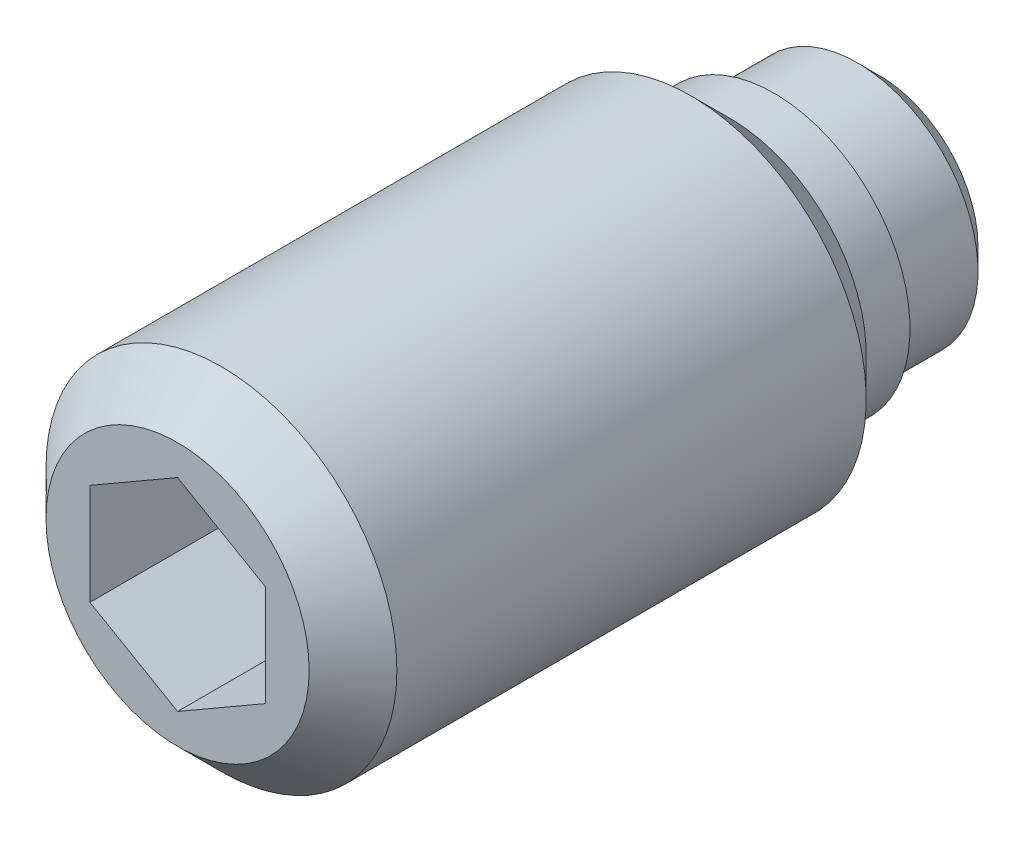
ISO-10303-21;
HEADER;
FILE_DESCRIPTION(('STEP AP214'),'2;1');
FILE_NAME('part.step','',(''),(''),'','','');
FILE_SCHEMA(('AUTOMOTIVE_DESIGN { 1 0 10303 214 1 1 1 1 }'));
ENDSEC;
DATA;
#1=APPLICATION_CONTEXT('core data for automotive mechanical design processes');
#2=APPLICATION_PROTOCOL_DEFINITION('international standard','automotive_design',2000,#1);
#3=PRODUCT_CONTEXT('',#1,'mechanical');
#4=PRODUCT('Part','Part','',(#3));
#5=PRODUCT_RELATED_PRODUCT_CATEGORY('part','',(#4));
#6=PRODUCT_DEFINITION_FORMATION('','',#4);
#7=PRODUCT_DEFINITION_CONTEXT('part definition',#1,'design');
#8=PRODUCT_DEFINITION('design','',#6,#7);
#9=PRODUCT_DEFINITION_SHAPE('','',#8);
#10=(LENGTH_UNIT() NAMED_UNIT(*) SI_UNIT(.MILLI.,.METRE.));
#11=(NAMED_UNIT(*) PLANE_ANGLE_UNIT() SI_UNIT($,.RADIAN.));
#12=(NAMED_UNIT(*) SI_UNIT($,.STERADIAN.) SOLID_ANGLE_UNIT());
#13=UNCERTAINTY_MEASURE_WITH_UNIT(LENGTH_MEASURE(1.E-05),#10,'distance_accuracy_value','');
#14=(GEOMETRIC_REPRESENTATION_CONTEXT(3) GLOBAL_UNCERTAINTY_ASSIGNED_CONTEXT((#13)) GLOBAL_UNIT_ASSIGNED_CONTEXT((#10,
#11,#12)) REPRESENTATION_CONTEXT('',''));
#15=CARTESIAN_POINT('',(0.,0.,0.));
#16=DIRECTION('',(0.,0.,1.));
#17=DIRECTION('',(1.,0.,0.));
#18=AXIS2_PLACEMENT_3D('',#15,#16,#17);
#19=CARTESIAN_POINT('',(0.,0.,2.4));
#20=DIRECTION('',(0.,0.,-1.));
#21=DIRECTION('',(-1.,0.,0.));
#22=AXIS2_PLACEMENT_3D('',#19,#20,#21);
#23=CYLINDRICAL_SURFACE('',#22,4.);
#24=CARTESIAN_POINT('',(0.,0.,15.));
#25=DIRECTION('',(0.,0.,1.));
#26=DIRECTION('',(1.,0.,0.));
#27=AXIS2_PLACEMENT_3D('',#24,#25,#26);
#28=CIRCLE('',#27,4.);
#29=CARTESIAN_POINT('',(4.,0.,15.));
#30=VERTEX_POINT('',#29);
#31=EDGE_CURVE('E9',#30,#30,#28,.F.);
#32=ORIENTED_EDGE('',*,*,#31,.T.);
#33=EDGE_LOOP('',(#32));
#34=FACE_BOUND('',#33,.T.);
#35=CARTESIAN_POINT('',(0.,0.,4.3));
#36=DIRECTION('',(0.,0.,-1.));
#37=DIRECTION('',(-1.,0.,0.));
#38=AXIS2_PLACEMENT_3D('',#35,#36,#37);
#39=CIRCLE('',#38,4.);
#40=CARTESIAN_POINT('',(-4.,0.,4.3));
#41=VERTEX_POINT('',#40);
#42=EDGE_CURVE('E74',#41,#41,#39,.T.);
#43=ORIENTED_EDGE('',*,*,#42,.F.);
#44=EDGE_LOOP('',(#43));
#45=FACE_BOUND('',#44,.T.);
#46=ADVANCED_FACE('F14',(#34,#45),#23,.T.);
#47=CARTESIAN_POINT('',(0.,0.,4.3));
#48=DIRECTION('',(0.,0.,1.));
#49=DIRECTION('',(1.,0.,0.));
#50=AXIS2_PLACEMENT_3D('',#47,#48,#49);
#51=CONICAL_SURFACE('',#50,4.,0.785398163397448);
#52=ORIENTED_EDGE('',*,*,#42,.T.);
#53=EDGE_LOOP('',(#52));
#54=FACE_BOUND('',#53,.T.);
#55=CARTESIAN_POINT('',(0.,0.,3.4));
#56=DIRECTION('',(0.,0.,-1.));
#57=DIRECTION('',(-1.,0.,0.));
#58=AXIS2_PLACEMENT_3D('',#55,#56,#57);
#59=CIRCLE('',#58,3.1);
#60=CARTESIAN_POINT('',(-3.1,0.,3.4));
#61=VERTEX_POINT('',#60);
#62=EDGE_CURVE('E112',#61,#61,#59,.T.);
#63=ORIENTED_EDGE('',*,*,#62,.F.);
#64=EDGE_LOOP('',(#63));
#65=FACE_BOUND('',#64,.T.);
#66=ADVANCED_FACE('F130',(#54,#65),#51,.T.);
#67=CARTESIAN_POINT('',(0.,0.,2.4));
#68=DIRECTION('',(0.,0.,-1.));
#69=DIRECTION('',(-1.,0.,0.));
#70=AXIS2_PLACEMENT_3D('',#67,#68,#69);
#71=CYLINDRICAL_SURFACE('',#70,3.1);
#72=ORIENTED_EDGE('',*,*,#62,.T.);
#73=EDGE_LOOP('',(#72));
#74=FACE_BOUND('',#73,.T.);
#75=CARTESIAN_POINT('',(0.,0.,2.4));
#76=DIRECTION('',(0.,0.,-1.));
#77=DIRECTION('',(-1.,0.,0.));
#78=AXIS2_PLACEMENT_3D('',#75,#76,#77);
#79=CIRCLE('',#78,3.1);
#80=CARTESIAN_POINT('',(-3.1,0.,2.4));
#81=VERTEX_POINT('',#80);
#82=EDGE_CURVE('E109',#81,#81,#79,.T.);
#83=ORIENTED_EDGE('',*,*,#82,.F.);
#84=EDGE_LOOP('',(#83));
#85=FACE_BOUND('',#84,.T.);
#86=ADVANCED_FACE('F135',(#74,#85),#71,.T.);
#87=CARTESIAN_POINT('',(0.,3.1,2.4));
#88=DIRECTION('',(0.,0.,1.));
#89=DIRECTION('',(1.,0.,0.));
#90=AXIS2_PLACEMENT_3D('',#87,#88,#89);
#91=PLANE('',#90);
#92=ORIENTED_EDGE('',*,*,#82,.T.);
#93=EDGE_LOOP('',(#92));
#94=FACE_BOUND('',#93,.T.);
#95=CARTESIAN_POINT('',(0.,0.,2.4));
#96=DIRECTION('',(0.,0.,-1.));
#97=DIRECTION('',(-1.,0.,0.));
#98=AXIS2_PLACEMENT_3D('',#95,#96,#97);
#99=CIRCLE('',#98,2.75);
#100=CARTESIAN_POINT('',(-2.75,0.,2.4));
#101=VERTEX_POINT('',#100);
#102=EDGE_CURVE('E106',#101,#101,#99,.T.);
#103=ORIENTED_EDGE('',*,*,#102,.F.);
#104=EDGE_LOOP('',(#103));
#105=FACE_BOUND('',#104,.T.);
#106=ADVANCED_FACE('F142',(#94,#105),#91,.F.);
#107=CARTESIAN_POINT('',(0.,0.,0.));
#108=DIRECTION('',(0.,0.,-1.));
#109=DIRECTION('',(-1.,0.,0.));
#110=AXIS2_PLACEMENT_3D('',#107,#108,#109);
#111=CYLINDRICAL_SURFACE('',#110,2.75);
#112=CARTESIAN_POINT('',(0.,0.,0.5));
#113=DIRECTION('',(0.,0.,-1.));
#114=DIRECTION('',(-1.,0.,0.));
#115=AXIS2_PLACEMENT_3D('',#112,#113,#114);
#116=CIRCLE('',#115,2.75);
#117=CARTESIAN_POINT('',(-2.75,0.,0.5));
#118=VERTEX_POINT('',#117);
#119=EDGE_CURVE('E103',#118,#118,#116,.T.);
#120=ORIENTED_EDGE('',*,*,#119,.F.);
#121=EDGE_LOOP('',(#120));
#122=FACE_BOUND('',#121,.T.);
#123=ORIENTED_EDGE('',*,*,#102,.T.);
#124=EDGE_LOOP('',(#123));
#125=FACE_BOUND('',#124,.T.);
#126=ADVANCED_FACE('F146',(#122,#125),#111,.T.);
#127=CARTESIAN_POINT('',(0.,0.,0.5));
#128=DIRECTION('',(0.,0.,1.));
#129=DIRECTION('',(1.,0.,0.));
#130=AXIS2_PLACEMENT_3D('',#127,#128,#129);
#131=CONICAL_SURFACE('',#130,2.75,0.785398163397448);
#132=CARTESIAN_POINT('',(0.,0.,0.));
#133=DIRECTION('',(0.,0.,-1.));
#134=DIRECTION('',(-1.,0.,0.));
#135=AXIS2_PLACEMENT_3D('',#132,#133,#134);
#136=CIRCLE('',#135,2.25);
#137=CARTESIAN_POINT('',(-2.25,0.,0.));
#138=VERTEX_POINT('',#137);
#139=EDGE_CURVE('E100',#138,#138,#136,.T.);
#140=ORIENTED_EDGE('',*,*,#139,.F.);
#141=EDGE_LOOP('',(#140));
#142=FACE_BOUND('',#141,.T.);
#143=ORIENTED_EDGE('',*,*,#119,.T.);
#144=EDGE_LOOP('',(#143));
#145=FACE_BOUND('',#144,.T.);
#146=ADVANCED_FACE('F150',(#142,#145),#131,.T.);
#147=CARTESIAN_POINT('',(0.,2.25,0.));
#148=DIRECTION('',(0.,0.,1.));
#149=DIRECTION('',(1.,0.,0.));
#150=AXIS2_PLACEMENT_3D('',#147,#148,#149);
#151=PLANE('',#150);
#152=ORIENTED_EDGE('',*,*,#139,.T.);
#153=EDGE_LOOP('',(#152));
#154=FACE_BOUND('',#153,.T.);
#155=ADVANCED_FACE('F154',(#154),#151,.F.);
#156=CARTESIAN_POINT('',(0.,0.,16.));
#157=DIRECTION('',(0.,0.,1.));
#158=DIRECTION('',(1.,0.,0.));
#159=AXIS2_PLACEMENT_3D('',#156,#157,#158);
#160=PLANE('',#159);
#161=CARTESIAN_POINT('',(0.,0.,16.));
#162=DIRECTION('',(0.,0.,1.));
#163=DIRECTION('',(1.,0.,0.));
#164=AXIS2_PLACEMENT_3D('',#161,#162,#163);
#165=CIRCLE('',#164,3.);
#166=CARTESIAN_POINT('',(3.,0.,16.));
#167=VERTEX_POINT('',#166);
#168=EDGE_CURVE('E22',#167,#167,#165,.T.);
#169=ORIENTED_EDGE('',*,*,#168,.T.);
#170=EDGE_LOOP('',(#169));
#171=FACE_BOUND('',#170,.T.);
#172=DIRECTION('',(-0.866025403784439,0.5,0.));
#173=VECTOR('',#172,1.);
#174=CARTESIAN_POINT('',(-2.,-1.15470053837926,16.));
#175=LINE('',#174,#173);
#176=CARTESIAN_POINT('',(0.,-2.30940107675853,16.));
#177=VERTEX_POINT('',#176);
#178=CARTESIAN_POINT('',(-2.,-1.15470053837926,16.));
#179=VERTEX_POINT('',#178);
#180=EDGE_CURVE('E69',#177,#179,#175,.T.);
#181=ORIENTED_EDGE('',*,*,#180,.T.);
#182=DIRECTION('',(0.,1.,0.));
#183=VECTOR('',#182,1.);
#184=CARTESIAN_POINT('',(-2.,1.15470053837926,16.));
#185=LINE('',#184,#183);
#186=CARTESIAN_POINT('',(-2.,1.15470053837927,16.));
#187=VERTEX_POINT('',#186);
#188=EDGE_CURVE('E84',#179,#187,#185,.T.);
#189=ORIENTED_EDGE('',*,*,#188,.T.);
#190=DIRECTION('',(0.866025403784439,0.5,0.));
#191=VECTOR('',#190,1.);
#192=CARTESIAN_POINT('',(0.,2.30940107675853,16.));
#193=LINE('',#192,#191);
#194=CARTESIAN_POINT('',(0.,2.30940107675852,16.));
#195=VERTEX_POINT('',#194);
#196=EDGE_CURVE('E300',#187,#195,#193,.T.);
#197=ORIENTED_EDGE('',*,*,#196,.T.);
#198=DIRECTION('',(0.866025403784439,-0.5,0.));
#199=VECTOR('',#198,1.);
#200=CARTESIAN_POINT('',(2.,1.15470053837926,16.));
#201=LINE('',#200,#199);
#202=CARTESIAN_POINT('',(2.,1.15470053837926,16.));
#203=VERTEX_POINT('',#202);
#204=EDGE_CURVE('E297',#195,#203,#201,.T.);
#205=ORIENTED_EDGE('',*,*,#204,.T.);
#206=DIRECTION('',(0.,-1.,0.));
#207=VECTOR('',#206,1.);
#208=CARTESIAN_POINT('',(2.,-1.15470053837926,16.));
#209=LINE('',#208,#207);
#210=CARTESIAN_POINT('',(2.,-1.15470053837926,16.));
#211=VERTEX_POINT('',#210);
#212=EDGE_CURVE('E29',#203,#211,#209,.T.);
#213=ORIENTED_EDGE('',*,*,#212,.T.);
#214=DIRECTION('',(-0.866025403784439,-0.5,0.));
#215=VECTOR('',#214,1.);
#216=CARTESIAN_POINT('',(0.,-2.30940107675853,16.));
#217=LINE('',#216,#215);
#218=EDGE_CURVE('E66',#211,#177,#217,.T.);
#219=ORIENTED_EDGE('',*,*,#218,.T.);
#220=EDGE_LOOP('',(#181,#189,#197,#205,#213,#219));
#221=FACE_BOUND('',#220,.T.);
#222=ADVANCED_FACE('F68',(#171,#221),#160,.T.);
#223=CARTESIAN_POINT('',(0.,0.,11.));
#224=DIRECTION('',(0.,0.,1.));
#225=DIRECTION('',(1.,0.,0.));
#226=AXIS2_PLACEMENT_3D('',#223,#224,#225);
#227=PLANE('',#226);
#228=DIRECTION('',(-0.866025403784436,-0.5,0.));
#229=VECTOR('',#228,1.);
#230=CARTESIAN_POINT('',(0.,2.30940107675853,11.));
#231=LINE('',#230,#229);
#232=CARTESIAN_POINT('',(0.,2.30940107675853,11.));
#233=VERTEX_POINT('',#232);
#234=CARTESIAN_POINT('',(-2.,1.15470053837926,11.));
#235=VERTEX_POINT('',#234);
#236=EDGE_CURVE('E83',#233,#235,#231,.T.);
#237=ORIENTED_EDGE('',*,*,#236,.T.);
#238=DIRECTION('',(0.,-1.,0.));
#239=VECTOR('',#238,1.);
#240=CARTESIAN_POINT('',(-2.,1.15470053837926,11.));
#241=LINE('',#240,#239);
#242=CARTESIAN_POINT('',(-2.,-1.15470053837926,11.));
#243=VERTEX_POINT('',#242);
#244=EDGE_CURVE('E282',#235,#243,#241,.T.);
#245=ORIENTED_EDGE('',*,*,#244,.T.);
#246=DIRECTION('',(0.866025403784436,-0.5,0.));
#247=VECTOR('',#246,1.);
#248=CARTESIAN_POINT('',(-2.,-1.15470053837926,11.));
#249=LINE('',#248,#247);
#250=CARTESIAN_POINT('',(0.,-2.30940107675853,11.));
#251=VERTEX_POINT('',#250);
#252=EDGE_CURVE('E285',#243,#251,#249,.T.);
#253=ORIENTED_EDGE('',*,*,#252,.T.);
#254=DIRECTION('',(0.866025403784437,0.5,0.));
#255=VECTOR('',#254,1.);
#256=CARTESIAN_POINT('',(0.,-2.30940107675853,11.));
#257=LINE('',#256,#255);
#258=CARTESIAN_POINT('',(2.,-1.15470053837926,11.));
#259=VERTEX_POINT('',#258);
#260=EDGE_CURVE('E88',#251,#259,#257,.T.);
#261=ORIENTED_EDGE('',*,*,#260,.T.);
#262=DIRECTION('',(0.,1.,0.));
#263=VECTOR('',#262,1.);
#264=CARTESIAN_POINT('',(2.,-1.15470053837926,11.));
#265=LINE('',#264,#263);
#266=CARTESIAN_POINT('',(2.,1.15470053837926,11.));
#267=VERTEX_POINT('',#266);
#268=EDGE_CURVE('E96',#259,#267,#265,.T.);
#269=ORIENTED_EDGE('',*,*,#268,.T.);
#270=DIRECTION('',(-0.866025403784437,0.5,0.));
#271=VECTOR('',#270,1.);
#272=CARTESIAN_POINT('',(2.,1.15470053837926,11.));
#273=LINE('',#272,#271);
#274=EDGE_CURVE('E91',#267,#233,#273,.T.);
#275=ORIENTED_EDGE('',*,*,#274,.T.);
#276=EDGE_LOOP('',(#237,#245,#253,#261,#269,#275));
#277=FACE_BOUND('',#276,.T.);
#278=ADVANCED_FACE('F162',(#277),#227,.T.);
#279=CARTESIAN_POINT('',(0.,-2.30940107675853,29.));
#280=DIRECTION('',(0.5,-0.866025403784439,0.));
#281=DIRECTION('',(0.866025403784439,0.5,0.));
#282=AXIS2_PLACEMENT_3D('',#279,#280,#281);
#283=PLANE('',#282);
#284=ORIENTED_EDGE('',*,*,#218,.F.);
#285=DIRECTION('',(0.,0.,1.));
#286=VECTOR('',#285,1.);
#287=CARTESIAN_POINT('',(2.,-1.15470053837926,29.));
#288=LINE('',#287,#286);
#289=EDGE_CURVE('E90',#259,#211,#288,.T.);
#290=ORIENTED_EDGE('',*,*,#289,.F.);
#291=ORIENTED_EDGE('',*,*,#260,.F.);
#292=DIRECTION('',(0.,0.,1.));
#293=VECTOR('',#292,1.);
#294=CARTESIAN_POINT('',(0.,-2.30940107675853,29.));
#295=LINE('',#294,#293);
#296=EDGE_CURVE('E80',#251,#177,#295,.T.);
#297=ORIENTED_EDGE('',*,*,#296,.T.);
#298=EDGE_LOOP('',(#284,#290,#291,#297));
#299=FACE_BOUND('',#298,.T.);
#300=ADVANCED_FACE('F86',(#299),#283,.F.);
#301=CARTESIAN_POINT('',(2.,-1.15470053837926,29.));
#302=DIRECTION('',(1.,0.,0.));
#303=DIRECTION('',(0.,0.,-1.));
#304=AXIS2_PLACEMENT_3D('',#301,#302,#303);
#305=PLANE('',#304);
#306=ORIENTED_EDGE('',*,*,#212,.F.);
#307=DIRECTION('',(0.,0.,1.));
#308=VECTOR('',#307,1.);
#309=CARTESIAN_POINT('',(2.,1.15470053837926,29.));
#310=LINE('',#309,#308);
#311=EDGE_CURVE('E93',#267,#203,#310,.T.);
#312=ORIENTED_EDGE('',*,*,#311,.F.);
#313=ORIENTED_EDGE('',*,*,#268,.F.);
#314=ORIENTED_EDGE('',*,*,#289,.T.);
#315=EDGE_LOOP('',(#306,#312,#313,#314));
#316=FACE_BOUND('',#315,.T.);
#317=ADVANCED_FACE('F161',(#316),#305,.F.);
#318=CARTESIAN_POINT('',(2.,1.15470053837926,29.));
#319=DIRECTION('',(0.5,0.866025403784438,0.));
#320=DIRECTION('',(-0.866025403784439,0.5,0.));
#321=AXIS2_PLACEMENT_3D('',#318,#319,#320);
#322=PLANE('',#321);
#323=ORIENTED_EDGE('',*,*,#204,.F.);
#324=DIRECTION('',(0.,0.,1.));
#325=VECTOR('',#324,1.);
#326=CARTESIAN_POINT('',(0.,2.30940107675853,29.));
#327=LINE('',#326,#325);
#328=EDGE_CURVE('E37',#233,#195,#327,.T.);
#329=ORIENTED_EDGE('',*,*,#328,.F.);
#330=ORIENTED_EDGE('',*,*,#274,.F.);
#331=ORIENTED_EDGE('',*,*,#311,.T.);
#332=EDGE_LOOP('',(#323,#329,#330,#331));
#333=FACE_BOUND('',#332,.T.);
#334=ADVANCED_FACE('F165',(#333),#322,.F.);
#335=CARTESIAN_POINT('',(0.,2.30940107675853,29.));
#336=DIRECTION('',(-0.5,0.866025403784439,0.));
#337=DIRECTION('',(-0.866025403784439,-0.5,0.));
#338=AXIS2_PLACEMENT_3D('',#335,#336,#337);
#339=PLANE('',#338);
#340=ORIENTED_EDGE('',*,*,#196,.F.);
#341=DIRECTION('',(0.,0.,1.));
#342=VECTOR('',#341,1.);
#343=CARTESIAN_POINT('',(-2.,1.15470053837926,29.));
#344=LINE('',#343,#342);
#345=EDGE_CURVE('E293',#235,#187,#344,.T.);
#346=ORIENTED_EDGE('',*,*,#345,.F.);
#347=ORIENTED_EDGE('',*,*,#236,.F.);
#348=ORIENTED_EDGE('',*,*,#328,.T.);
#349=EDGE_LOOP('',(#340,#346,#347,#348));
#350=FACE_BOUND('',#349,.T.);
#351=ADVANCED_FACE('F169',(#350),#339,.F.);
#352=CARTESIAN_POINT('',(-2.,1.15470053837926,29.));
#353=DIRECTION('',(-1.,0.,0.));
#354=DIRECTION('',(0.,0.,1.));
#355=AXIS2_PLACEMENT_3D('',#352,#353,#354);
#356=PLANE('',#355);
#357=ORIENTED_EDGE('',*,*,#188,.F.);
#358=DIRECTION('',(0.,0.,1.));
#359=VECTOR('',#358,1.);
#360=CARTESIAN_POINT('',(-2.,-1.15470053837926,29.));
#361=LINE('',#360,#359);
#362=EDGE_CURVE('E82',#243,#179,#361,.T.);
#363=ORIENTED_EDGE('',*,*,#362,.F.);
#364=ORIENTED_EDGE('',*,*,#244,.F.);
#365=ORIENTED_EDGE('',*,*,#345,.T.);
#366=EDGE_LOOP('',(#357,#363,#364,#365));
#367=FACE_BOUND('',#366,.T.);
#368=ADVANCED_FACE('F126',(#367),#356,.F.);
#369=CARTESIAN_POINT('',(-2.,-1.15470053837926,29.));
#370=DIRECTION('',(-0.5,-0.866025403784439,0.));
#371=DIRECTION('',(0.866025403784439,-0.5,0.));
#372=AXIS2_PLACEMENT_3D('',#369,#370,#371);
#373=PLANE('',#372);
#374=ORIENTED_EDGE('',*,*,#180,.F.);
#375=ORIENTED_EDGE('',*,*,#296,.F.);
#376=ORIENTED_EDGE('',*,*,#252,.F.);
#377=ORIENTED_EDGE('',*,*,#362,.T.);
#378=EDGE_LOOP('',(#374,#375,#376,#377));
#379=FACE_BOUND('',#378,.T.);
#380=ADVANCED_FACE('F78',(#379),#373,.F.);
#381=CARTESIAN_POINT('',(0.,0.,16.));
#382=DIRECTION('',(0.,0.,-1.));
#383=DIRECTION('',(-1.,0.,0.));
#384=AXIS2_PLACEMENT_3D('',#381,#382,#383);
#385=CONICAL_SURFACE('',#384,3.,0.785398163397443);
#386=ORIENTED_EDGE('',*,*,#31,.F.);
#387=EDGE_LOOP('',(#386));
#388=FACE_BOUND('',#387,.T.);
#389=ORIENTED_EDGE('',*,*,#168,.F.);
#390=EDGE_LOOP('',(#389));
#391=FACE_BOUND('',#390,.T.);
#392=ADVANCED_FACE('F16',(#388,#391),#385,.T.);
#393=CLOSED_SHELL('',(#46,#66,#86,#106,#126,#146,#155,#222,#278,#300,#317,#334,#351,#368,#380,#392));
#394=MANIFOLD_SOLID_BREP('B1',#393);
#395=ADVANCED_BREP_SHAPE_REPRESENTATION('',(#18,#394),#14);
#396=SHAPE_DEFINITION_REPRESENTATION(#9,#395);
ENDSEC;
END-ISO-10303-21;
